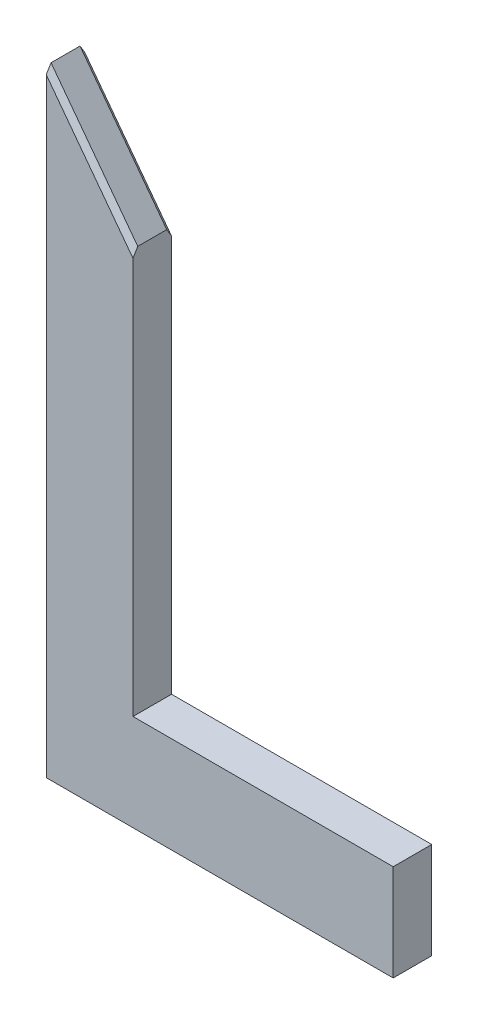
from build123d import *

# Parameters (mm, degrees)
BASE_EXTRUDE_DEPTH  = 12.7
CHAMFER2_SIZE       = 1.5748
EXTRUDE1_DEPTH      = 255.31730181
EXTRUDE1_DEPTH_BACK = 255.31730181
CUT_EXTRUDE1_DEPTH  = 234.486659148


with BuildPart() as part:
    # Sketch1 → Base-Extrude (new body)
    with BuildSketch(Plane.XY):
        Polygon((0, 0), (152.4, 0), (0, 203.2), align=None)
    extrude(amount=-BASE_EXTRUDE_DEPTH)

    # Chamfer2
    chamfer2_edges = [part.edges().sort_by_distance(p)[0] for p in [
        (76.2, 101.6, -12.7),
        (76.2, 101.6, 0),
    ]]
    chamfer(chamfer2_edges, length=CHAMFER2_SIZE)

    # Sketch3 → Extrude1 (cut, two sides: drawn at the far end of the back side and taken through both)
    with BuildSketch(Plane.XY.offset(-EXTRUDE1_DEPTH_BACK)):
        Polygon((114.3, -476.282017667), (114.3, 0), (114.3, 50.8), (114.3, 527.082017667), (1066.864035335, 527.082017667), (1066.864035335, -476.282017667), align=None)
    extrude(amount=EXTRUDE1_DEPTH + EXTRUDE1_DEPTH_BACK, mode=Mode.SUBTRACT)

    # Sketch4 → Cut-Extrude1 (cut, through all)
    with BuildSketch(Plane.XY):
        Polygon((114.3, 31.75), (28.575, 31.75), (28.575, 184.15), (142.875, 31.75), align=None)
    extrude(amount=-CUT_EXTRUDE1_DEPTH, mode=Mode.SUBTRACT)


solid = part.part
